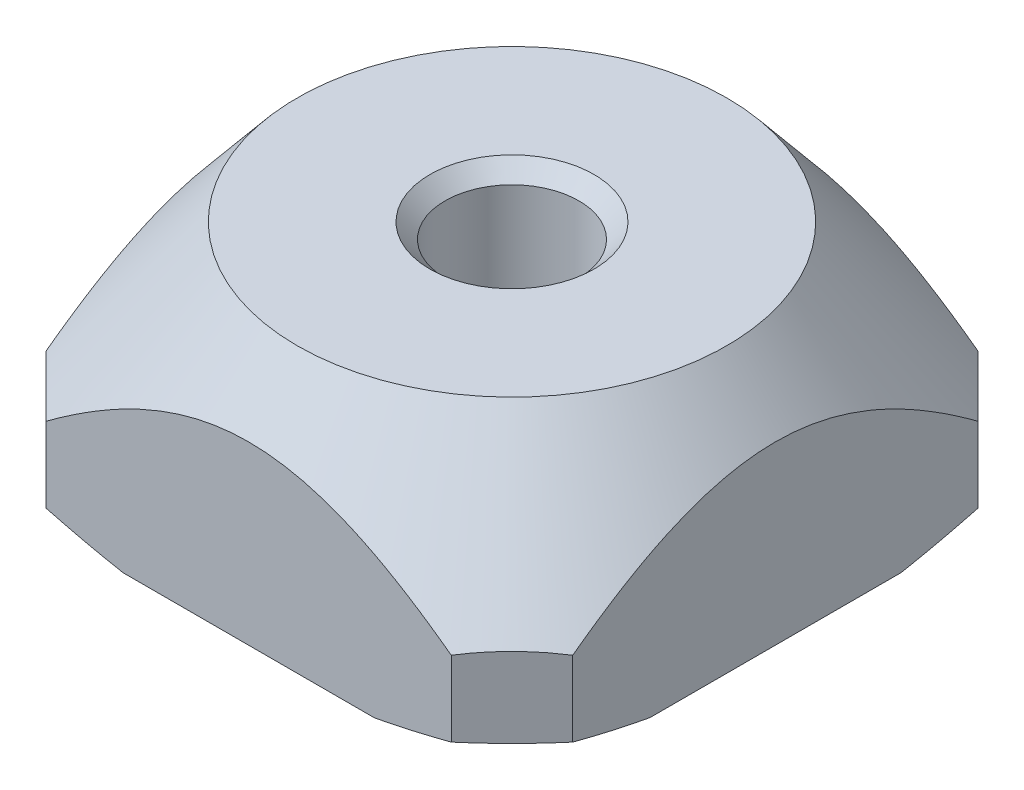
ISO-10303-21;
HEADER;
FILE_DESCRIPTION(('STEP AP214'),'2;1');
FILE_NAME('part.step','',(''),(''),'','','');
FILE_SCHEMA(('AUTOMOTIVE_DESIGN { 1 0 10303 214 1 1 1 1 }'));
ENDSEC;
DATA;
#1=APPLICATION_CONTEXT('core data for automotive mechanical design processes');
#2=APPLICATION_PROTOCOL_DEFINITION('international standard','automotive_design',2000,#1);
#3=PRODUCT_CONTEXT('',#1,'mechanical');
#4=PRODUCT('Part','Part','',(#3));
#5=PRODUCT_RELATED_PRODUCT_CATEGORY('part','',(#4));
#6=PRODUCT_DEFINITION_FORMATION('','',#4);
#7=PRODUCT_DEFINITION_CONTEXT('part definition',#1,'design');
#8=PRODUCT_DEFINITION('design','',#6,#7);
#9=PRODUCT_DEFINITION_SHAPE('','',#8);
#10=(LENGTH_UNIT() NAMED_UNIT(*) SI_UNIT(.MILLI.,.METRE.));
#11=(NAMED_UNIT(*) PLANE_ANGLE_UNIT() SI_UNIT($,.RADIAN.));
#12=(NAMED_UNIT(*) SI_UNIT($,.STERADIAN.) SOLID_ANGLE_UNIT());
#13=UNCERTAINTY_MEASURE_WITH_UNIT(LENGTH_MEASURE(1.E-05),#10,'distance_accuracy_value','');
#14=(GEOMETRIC_REPRESENTATION_CONTEXT(3) GLOBAL_UNCERTAINTY_ASSIGNED_CONTEXT((#13)) GLOBAL_UNIT_ASSIGNED_CONTEXT((#10,
#11,#12)) REPRESENTATION_CONTEXT('',''));
#15=CARTESIAN_POINT('',(0.,0.,0.));
#16=DIRECTION('',(0.,0.,1.));
#17=DIRECTION('',(1.,0.,0.));
#18=AXIS2_PLACEMENT_3D('',#15,#16,#17);
#19=CARTESIAN_POINT('',(0.,5.8,0.));
#20=DIRECTION('',(0.,-1.,0.));
#21=DIRECTION('',(0.,0.,-1.));
#22=AXIS2_PLACEMENT_3D('',#19,#20,#21);
#23=PLANE('',#22);
#24=CARTESIAN_POINT('',(0.,5.8,0.));
#25=DIRECTION('',(0.,-1.,0.));
#26=DIRECTION('',(0.,0.,-1.));
#27=AXIS2_PLACEMENT_3D('',#24,#25,#26);
#28=CIRCLE('',#27,5.3);
#29=CARTESIAN_POINT('',(0.,5.8,-5.3));
#30=VERTEX_POINT('',#29);
#31=EDGE_CURVE('E471',#30,#30,#28,.T.);
#32=ORIENTED_EDGE('',*,*,#31,.F.);
#33=EDGE_LOOP('',(#32));
#34=FACE_BOUND('',#33,.T.);
#35=CARTESIAN_POINT('',(0.,5.79999999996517,0.));
#36=DIRECTION('',(0.,1.,0.));
#37=DIRECTION('',(0.,0.,1.));
#38=AXIS2_PLACEMENT_3D('',#35,#36,#37);
#39=CIRCLE('',#38,2.02499999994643);
#40=CARTESIAN_POINT('',(0.,5.79999999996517,2.02499999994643));
#41=VERTEX_POINT('',#40);
#42=EDGE_CURVE('E19',#41,#41,#39,.F.);
#43=ORIENTED_EDGE('',*,*,#42,.T.);
#44=EDGE_LOOP('',(#43));
#45=FACE_BOUND('',#44,.T.);
#46=ADVANCED_FACE('F16',(#34,#45),#23,.F.);
#47=CARTESIAN_POINT('',(0.,5.79999999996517,0.));
#48=DIRECTION('',(0.,1.,0.));
#49=DIRECTION('',(0.,0.,1.));
#50=AXIS2_PLACEMENT_3D('',#47,#48,#49);
#51=CONICAL_SURFACE('',#50,2.02499999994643,0.785398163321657);
#52=ORIENTED_EDGE('',*,*,#42,.F.);
#53=EDGE_LOOP('',(#52));
#54=FACE_BOUND('',#53,.T.);
#55=CARTESIAN_POINT('',(0.,5.425,0.));
#56=DIRECTION('',(0.,1.,0.));
#57=DIRECTION('',(0.,0.,1.));
#58=AXIS2_PLACEMENT_3D('',#55,#56,#57);
#59=CIRCLE('',#58,1.65);
#60=CARTESIAN_POINT('',(0.,5.425,1.65));
#61=VERTEX_POINT('',#60);
#62=EDGE_CURVE('E150',#61,#61,#59,.F.);
#63=ORIENTED_EDGE('',*,*,#62,.T.);
#64=EDGE_LOOP('',(#63));
#65=FACE_BOUND('',#64,.T.);
#66=ADVANCED_FACE('F358',(#54,#65),#51,.F.);
#67=CARTESIAN_POINT('',(5.00093362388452,37.1474583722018,-6.5));
#68=DIRECTION('',(0.707106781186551,0.,-0.707106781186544));
#69=DIRECTION('',(-0.707106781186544,0.,-0.707106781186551));
#70=AXIS2_PLACEMENT_3D('',#67,#68,#69);
#71=PLANE('',#70);
#72=DIRECTION('',(0.,1.,0.));
#73=VECTOR('',#72,1.);
#74=CARTESIAN_POINT('',(5.00093362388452,5.8,-6.5));
#75=LINE('',#74,#73);
#76=CARTESIAN_POINT('',(5.00093356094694,0.429511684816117,-6.50000006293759));
#77=VERTEX_POINT('',#76);
#78=CARTESIAN_POINT('',(5.00093364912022,2.28669481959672,-6.49999997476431));
#79=VERTEX_POINT('',#78);
#80=EDGE_CURVE('E108',#77,#79,#75,.T.);
#81=ORIENTED_EDGE('',*,*,#80,.T.);
#82=CARTESIAN_POINT('',(6.50000003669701,2.28669480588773,-5.0009335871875));
#83=CARTESIAN_POINT('',(6.43784742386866,2.30045539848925,-5.06308620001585));
#84=CARTESIAN_POINT('',(6.37551621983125,2.31256643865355,-5.12541740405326));
#85=CARTESIAN_POINT('',(6.25056780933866,2.33340084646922,-5.25036581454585));
#86=CARTESIAN_POINT('',(6.18795058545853,2.34212400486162,-5.31298303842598));
#87=CARTESIAN_POINT('',(6.00058150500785,2.36298820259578,-5.50035211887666));
#88=CARTESIAN_POINT('',(5.87552418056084,2.36999999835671,-5.62540944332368));
#89=CARTESIAN_POINT('',(5.62540953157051,2.3700000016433,-5.87552409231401));
#90=CARTESIAN_POINT('',(5.5003522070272,2.36298820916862,-6.00058141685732));
#91=CARTESIAN_POINT('',(5.31298312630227,2.34212401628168,-6.18795049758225));
#92=CARTESIAN_POINT('',(5.25036590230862,2.33340085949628,-6.25056772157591));
#93=CARTESIAN_POINT('',(5.12541749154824,2.31256645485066,-6.37551613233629));
#94=CARTESIAN_POINT('',(5.06308628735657,2.30045541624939,-6.43784733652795));
#95=CARTESIAN_POINT('',(5.00093367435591,2.28669482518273,-6.49999994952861));
#96=B_SPLINE_CURVE_WITH_KNOTS('',3,(#82,#83,#84,#85,#86,#87,#88,#89,#90,#91,#92,#93,#94,#95),
.UNSPECIFIED.,.F.,.F.,(4,2,2,2,2,2,4),(0.,0.26687453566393,0.533765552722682,1.06417199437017,
1.59457843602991,1.86146945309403,2.12834398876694),.UNSPECIFIED.);
#97=CARTESIAN_POINT('',(6.5000000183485,2.28669481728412,-5.00093359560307));
#98=VERTEX_POINT('',#97);
#99=EDGE_CURVE('E101',#98,#79,#96,.T.);
#100=ORIENTED_EDGE('',*,*,#99,.F.);
#101=DIRECTION('',(0.,1.,0.));
#102=VECTOR('',#101,1.);
#103=CARTESIAN_POINT('',(6.5,5.8,-5.00093362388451));
#104=LINE('',#103,#102);
#105=CARTESIAN_POINT('',(6.50000003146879,0.429511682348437,-5.00093359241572));
#106=VERTEX_POINT('',#105);
#107=EDGE_CURVE('E106',#98,#106,#104,.F.);
#108=ORIENTED_EDGE('',*,*,#107,.T.);
#109=CARTESIAN_POINT('',(5.00093349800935,0.429511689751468,-6.50000012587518));
#110=CARTESIAN_POINT('',(5.12577543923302,0.419709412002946,-6.37515818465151));
#111=CARTESIAN_POINT('',(5.25071389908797,0.412329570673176,-6.25021972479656));
#112=CARTESIAN_POINT('',(5.50059054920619,0.402476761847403,-6.00034307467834));
#113=CARTESIAN_POINT('',(5.62552866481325,0.400000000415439,-5.87540495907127));
#114=CARTESIAN_POINT('',(5.8754048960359,0.399999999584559,-5.62552872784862));
#115=CARTESIAN_POINT('',(6.00034301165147,0.40247676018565,-5.50059061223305));
#116=CARTESIAN_POINT('',(6.25021966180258,0.412329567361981,-5.25071396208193));
#117=CARTESIAN_POINT('',(6.37515812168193,0.419709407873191,-5.12577550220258));
#118=CARTESIAN_POINT('',(6.50000006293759,0.429511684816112,-5.00093356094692));
#119=B_SPLINE_CURVE_WITH_KNOTS('',3,(#109,#110,#111,#112,#113,#114,#115,#116,#117,#118),
.UNSPECIFIED.,.F.,.F.,(4,2,2,2,4),(0.,0.530461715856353,1.06051280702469,1.59056389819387,
2.12102561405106),.UNSPECIFIED.);
#120=EDGE_CURVE('E141',#77,#106,#119,.T.);
#121=ORIENTED_EDGE('',*,*,#120,.F.);
#122=EDGE_LOOP('',(#81,#100,#108,#121));
#123=FACE_BOUND('',#122,.T.);
#124=ADVANCED_FACE('F103',(#123),#71,.T.);
#125=CARTESIAN_POINT('',(6.50000000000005,29.8974583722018,5.00093362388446));
#126=DIRECTION('',(0.707106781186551,0.,0.707106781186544));
#127=DIRECTION('',(0.707106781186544,0.,-0.707106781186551));
#128=AXIS2_PLACEMENT_3D('',#125,#126,#127);
#129=PLANE('',#128);
#130=DIRECTION('',(0.,1.,0.));
#131=VECTOR('',#130,1.);
#132=CARTESIAN_POINT('',(6.5,5.8,5.00093362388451));
#133=LINE('',#132,#131);
#134=CARTESIAN_POINT('',(6.50000006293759,0.429511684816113,5.00093356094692));
#135=VERTEX_POINT('',#134);
#136=CARTESIAN_POINT('',(6.5,2.28669481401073,5.00093362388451));
#137=VERTEX_POINT('',#136);
#138=EDGE_CURVE('E120',#135,#137,#133,.T.);
#139=ORIENTED_EDGE('',*,*,#138,.T.);
#140=CARTESIAN_POINT('',(6.5,2.28669481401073,5.00093362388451));
#141=CARTESIAN_POINT('',(6.43784738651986,2.30045540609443,5.06308623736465));
#142=CARTESIAN_POINT('',(6.37551618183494,2.31256644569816,5.12541744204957));
#143=CARTESIAN_POINT('',(6.25056777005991,2.33340085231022,5.25036585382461));
#144=CARTESIAN_POINT('',(6.18795054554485,2.34212401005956,5.31298307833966));
#145=CARTESIAN_POINT('',(6.00058146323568,2.36298820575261,5.50035216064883));
#146=CARTESIAN_POINT('',(5.87552413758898,2.37,5.62540948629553));
#147=CARTESIAN_POINT('',(5.62540948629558,2.37,5.87552413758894));
#148=CARTESIAN_POINT('',(5.50035216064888,2.36298820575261,6.00058146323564));
#149=CARTESIAN_POINT('',(5.31298307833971,2.34212401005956,6.18795054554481));
#150=CARTESIAN_POINT('',(5.25036585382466,2.33340085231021,6.25056777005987));
#151=CARTESIAN_POINT('',(5.12541744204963,2.31256644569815,6.3755161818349));
#152=CARTESIAN_POINT('',(5.0630862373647,2.30045540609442,6.43784738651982));
#153=CARTESIAN_POINT('',(5.00093362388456,2.28669481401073,6.49999999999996));
#154=B_SPLINE_CURVE_WITH_KNOTS('',3,(#140,#141,#142,#143,#144,#145,#146,#147,#148,#149,#150,
#151,#152,#153),.UNSPECIFIED.,.F.,.F.,(4,2,2,2,2,2,4),(0.,0.266874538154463,0.533765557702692,
1.06417200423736,1.59457845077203,1.86146947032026,2.12834400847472),.UNSPECIFIED.);
#155=CARTESIAN_POINT('',(5.00093362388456,2.28669481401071,6.49999999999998));
#156=VERTEX_POINT('',#155);
#157=EDGE_CURVE('E111',#137,#156,#154,.T.);
#158=ORIENTED_EDGE('',*,*,#157,.T.);
#159=DIRECTION('',(0.,1.,0.));
#160=VECTOR('',#159,1.);
#161=CARTESIAN_POINT('',(5.00093362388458,5.8,6.5));
#162=LINE('',#161,#160);
#163=CARTESIAN_POINT('',(5.00093359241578,0.429511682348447,6.50000003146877));
#164=VERTEX_POINT('',#163);
#165=EDGE_CURVE('E260',#156,#164,#162,.F.);
#166=ORIENTED_EDGE('',*,*,#165,.T.);
#167=CARTESIAN_POINT('',(6.50000012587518,0.429511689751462,5.00093349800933));
#168=CARTESIAN_POINT('',(6.37515818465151,0.419709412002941,5.125775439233));
#169=CARTESIAN_POINT('',(6.25021972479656,0.412329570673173,5.25071389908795));
#170=CARTESIAN_POINT('',(6.00034307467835,0.402476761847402,5.50059054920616));
#171=CARTESIAN_POINT('',(5.87540495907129,0.400000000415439,5.62552866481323));
#172=CARTESIAN_POINT('',(5.62552872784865,0.39999999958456,5.87540489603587));
#173=CARTESIAN_POINT('',(5.50059061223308,0.402476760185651,6.00034301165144));
#174=CARTESIAN_POINT('',(5.25071396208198,0.412329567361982,6.25021966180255));
#175=CARTESIAN_POINT('',(5.12577550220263,0.419709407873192,6.3751581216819));
#176=CARTESIAN_POINT('',(5.00093356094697,0.429511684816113,6.50000006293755));
#177=B_SPLINE_CURVE_WITH_KNOTS('',3,(#167,#168,#169,#170,#171,#172,#173,#174,#175,#176),
.UNSPECIFIED.,.F.,.F.,(4,2,2,2,4),(0.,0.530461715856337,1.06051280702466,1.59056389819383,
2.121025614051),.UNSPECIFIED.);
#178=EDGE_CURVE('E275',#135,#164,#177,.T.);
#179=ORIENTED_EDGE('',*,*,#178,.F.);
#180=EDGE_LOOP('',(#139,#158,#166,#179));
#181=FACE_BOUND('',#180,.T.);
#182=ADVANCED_FACE('F330',(#181),#129,.T.);
#183=CARTESIAN_POINT('',(0.,2.26561498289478,0.));
#184=DIRECTION('',(0.,-1.,0.));
#185=DIRECTION('',(0.,0.,-1.));
#186=AXIS2_PLACEMENT_3D('',#183,#184,#185);
#187=CONICAL_SURFACE('',#186,8.218586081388,0.690257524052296);
#188=ORIENTED_EDGE('',*,*,#31,.T.);
#189=EDGE_LOOP('',(#188));
#190=FACE_BOUND('',#189,.T.);
#191=CARTESIAN_POINT('',(-5.00093362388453,2.28669481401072,6.5));
#192=CARTESIAN_POINT('',(-5.06308623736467,2.30045540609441,6.43784738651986));
#193=CARTESIAN_POINT('',(-5.12541744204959,2.31256644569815,6.37551618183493));
#194=CARTESIAN_POINT('',(-5.25036585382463,2.33340085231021,6.2505677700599));
#195=CARTESIAN_POINT('',(-5.31298307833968,2.34212401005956,6.18795054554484));
#196=CARTESIAN_POINT('',(-5.50035216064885,2.3629882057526,6.00058146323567));
#197=CARTESIAN_POINT('',(-5.62540948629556,2.37,5.87552413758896));
#198=CARTESIAN_POINT('',(-5.87552413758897,2.37000000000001,5.62540948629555));
#199=CARTESIAN_POINT('',(-6.00058146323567,2.36298820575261,5.50035216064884));
#200=CARTESIAN_POINT('',(-6.18795054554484,2.34212401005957,5.31298307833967));
#201=CARTESIAN_POINT('',(-6.2505677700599,2.33340085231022,5.25036585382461));
#202=CARTESIAN_POINT('',(-6.37551618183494,2.31256644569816,5.12541744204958));
#203=CARTESIAN_POINT('',(-6.43784738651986,2.30045540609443,5.06308623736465));
#204=CARTESIAN_POINT('',(-6.5,2.28669481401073,5.00093362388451));
#205=B_SPLINE_CURVE_WITH_KNOTS('',3,(#191,#192,#193,#194,#195,#196,#197,#198,#199,#200,#201,
#202,#203,#204),.UNSPECIFIED.,.F.,.F.,(4,2,2,2,2,2,4),(0.,0.26687453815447,0.533765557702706,
1.06417200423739,1.59457845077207,1.8614694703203,2.12834400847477),.UNSPECIFIED.);
#206=CARTESIAN_POINT('',(-5.00093362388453,2.28669481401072,6.5));
#207=VERTEX_POINT('',#206);
#208=CARTESIAN_POINT('',(-6.5,2.28669481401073,5.00093362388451));
#209=VERTEX_POINT('',#208);
#210=EDGE_CURVE('E336',#207,#209,#205,.T.);
#211=ORIENTED_EDGE('',*,*,#210,.F.);
#212=CARTESIAN_POINT('',(-5.00093362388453,2.28669481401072,6.5));
#213=CARTESIAN_POINT('',(-4.89461882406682,2.36519488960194,6.5));
#214=CARTESIAN_POINT('',(-4.78756060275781,2.44268666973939,6.5));
#215=CARTESIAN_POINT('',(-4.57178170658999,2.59536506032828,6.5));
#216=CARTESIAN_POINT('',(-4.46306069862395,2.67055119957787,6.5));
#217=CARTESIAN_POINT('',(-4.13342181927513,2.89269870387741,6.5));
#218=CARTESIAN_POINT('',(-3.90978571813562,3.03568366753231,6.5));
#219=CARTESIAN_POINT('',(-3.4465789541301,3.31215846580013,6.5));
#220=CARTESIAN_POINT('',(-3.20672602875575,3.44517986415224,6.5));
#221=CARTESIAN_POINT('',(-2.7170779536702,3.69103259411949,6.5));
#222=CARTESIAN_POINT('',(-2.46729714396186,3.80389183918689,6.5));
#223=CARTESIAN_POINT('',(-2.03482702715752,3.97262521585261,6.5));
#224=CARTESIAN_POINT('',(-1.85483896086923,4.03539099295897,6.5));
#225=CARTESIAN_POINT('',(-1.49011877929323,4.14544511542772,6.5));
#226=CARTESIAN_POINT('',(-1.30538676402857,4.19273378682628,6.5));
#227=CARTESIAN_POINT('',(-0.934834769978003,4.26884620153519,6.5));
#228=CARTESIAN_POINT('',(-0.749067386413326,4.29792233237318,6.5));
#229=CARTESIAN_POINT('',(-0.375528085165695,4.33690000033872,6.5));
#230=CARTESIAN_POINT('',(-0.187756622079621,4.34680579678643,6.5));
#231=CARTESIAN_POINT('',(0.16789069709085,4.34681251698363,6.5));
#232=CARTESIAN_POINT('',(0.335769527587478,4.33889803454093,6.5));
#233=CARTESIAN_POINT('',(0.670076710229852,4.30766815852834,6.5));
#234=CARTESIAN_POINT('',(0.836505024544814,4.28435236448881,6.5));
#235=CARTESIAN_POINT('',(1.16887468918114,4.22305769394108,6.5));
#236=CARTESIAN_POINT('',(1.3347807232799,4.18488964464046,6.5));
#237=CARTESIAN_POINT('',(1.66300269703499,4.09557989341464,6.5));
#238=CARTESIAN_POINT('',(1.82531875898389,4.04443863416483,6.5));
#239=CARTESIAN_POINT('',(2.26283278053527,3.88965064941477,6.5));
#240=CARTESIAN_POINT('',(2.53410341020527,3.77489830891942,6.5));
#241=CARTESIAN_POINT('',(3.06513239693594,3.5205626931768,6.5));
#242=CARTESIAN_POINT('',(3.32486424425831,3.38092559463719,6.5));
#243=CARTESIAN_POINT('',(3.702501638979,3.16031756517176,6.5));
#244=CARTESIAN_POINT('',(3.82449988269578,3.08620976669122,6.5));
#245=CARTESIAN_POINT('',(4.06621203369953,2.93433161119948,6.5));
#246=CARTESIAN_POINT('',(4.18592578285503,2.85656100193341,6.5));
#247=CARTESIAN_POINT('',(4.422624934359,2.69829475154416,6.5));
#248=CARTESIAN_POINT('',(4.53962131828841,2.6178154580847,6.5));
#249=CARTESIAN_POINT('',(4.77167680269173,2.45417264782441,6.5));
#250=CARTESIAN_POINT('',(4.88673641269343,2.37100985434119,6.5));
#251=CARTESIAN_POINT('',(5.00093362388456,2.2866948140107,6.5));
#252=B_SPLINE_CURVE_WITH_KNOTS('',3,(#212,#213,#214,#215,#216,#217,#218,#219,#220,#221,#222,
#223,#224,#225,#226,#227,#228,#229,#230,#231,#232,#233,#234,#235,#236,#237,#238,#239,#240,#241,
#242,#243,#244,#245,#246,#247,#248,#249,#250,#251),.UNSPECIFIED.,.F.,.F.,(4,2,2,2,2,2,2,2,2,2,2,
2,2,2,2,2,2,2,2,4),(0.,0.396455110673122,0.792990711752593,1.58889552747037,2.41103939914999,
3.23203608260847,3.80332089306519,4.37459366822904,4.93776368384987,5.50080855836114,
6.00427946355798,6.50776346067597,7.01788207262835,7.52798328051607,8.40977024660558,
9.29348810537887,9.72166656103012,10.1498745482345,10.5758468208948,11.0017052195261),.UNSPECIFIED.);
#253=EDGE_CURVE('E261',#207,#156,#252,.T.);
#254=ORIENTED_EDGE('',*,*,#253,.T.);
#255=ORIENTED_EDGE('',*,*,#157,.F.);
#256=CARTESIAN_POINT('',(6.5,2.28669481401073,5.00093362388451));
#257=CARTESIAN_POINT('',(6.5,2.36546542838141,4.89425230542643));
#258=CARTESIAN_POINT('',(6.5,2.44322075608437,4.78682264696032));
#259=CARTESIAN_POINT('',(6.5,2.59640967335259,4.57028828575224));
#260=CARTESIAN_POINT('',(6.5,2.67184277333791,4.46118323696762));
#261=CARTESIAN_POINT('',(6.5,2.89472597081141,4.13033374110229));
#262=CARTESIAN_POINT('',(6.5,3.03816727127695,3.90584895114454));
#263=CARTESIAN_POINT('',(6.5,3.31446263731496,3.44248350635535));
#264=CARTESIAN_POINT('',(6.5,3.44694761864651,3.20338079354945));
#265=CARTESIAN_POINT('',(6.5,3.69182258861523,2.71532773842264));
#266=CARTESIAN_POINT('',(6.5,3.80424366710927,2.46639337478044));
#267=CARTESIAN_POINT('',(6.5,3.96403148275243,2.05685433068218));
#268=CARTESIAN_POINT('',(6.5,4.01970687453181,1.89949160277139));
#269=CARTESIAN_POINT('',(6.5,4.11943260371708,1.58107070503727));
#270=CARTESIAN_POINT('',(6.5,4.16348252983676,1.42001240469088));
#271=CARTESIAN_POINT('',(6.5,4.23795252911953,1.09621460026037));
#272=CARTESIAN_POINT('',(6.5,4.26848771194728,0.93350186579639));
#273=CARTESIAN_POINT('',(6.5,4.31512465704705,0.606006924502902));
#274=CARTESIAN_POINT('',(6.5,4.33122767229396,0.441224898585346));
#275=CARTESIAN_POINT('',(6.5,4.34827314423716,0.109455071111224));
#276=CARTESIAN_POINT('',(6.5,4.34908501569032,-0.0575395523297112));
#277=CARTESIAN_POINT('',(6.5,4.33517110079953,-0.390873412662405));
#278=CARTESIAN_POINT('',(6.5,4.32044494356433,-0.557212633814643));
#279=CARTESIAN_POINT('',(6.5,4.2761251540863,-0.88848991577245));
#280=CARTESIAN_POINT('',(6.5,4.24647760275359,-1.05342067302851));
#281=CARTESIAN_POINT('',(6.5,4.17365597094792,-1.3802445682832));
#282=CARTESIAN_POINT('',(6.5,4.13047995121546,-1.54213726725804));
#283=CARTESIAN_POINT('',(6.5,4.00941900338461,-1.93674499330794));
#284=CARTESIAN_POINT('',(6.5,3.92473121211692,-2.16737187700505));
#285=CARTESIAN_POINT('',(6.5,3.73524387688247,-2.62020320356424));
#286=CARTESIAN_POINT('',(6.5,3.6304297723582,-2.84240140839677));
#287=CARTESIAN_POINT('',(6.5,3.40508735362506,-3.27921361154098));
#288=CARTESIAN_POINT('',(6.5,3.2845244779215,-3.49380956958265));
#289=CARTESIAN_POINT('',(6.5,3.03152298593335,-3.91571764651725));
#290=CARTESIAN_POINT('',(6.5,2.89908838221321,-4.12303219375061));
#291=CARTESIAN_POINT('',(6.5,2.68529870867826,-4.44159950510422));
#292=CARTESIAN_POINT('',(6.5,2.60709917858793,-4.55499497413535));
#293=CARTESIAN_POINT('',(6.5,2.44851798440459,-4.77950010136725));
#294=CARTESIAN_POINT('',(6.5,2.36814750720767,-4.89061765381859));
#295=CARTESIAN_POINT('',(6.5,2.28669482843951,-5.00093360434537));
#296=B_SPLINE_CURVE_WITH_KNOTS('',3,(#256,#257,#258,#259,#260,#261,#262,#263,#264,#265,#266,
#267,#268,#269,#270,#271,#272,#273,#274,#275,#276,#277,#278,#279,#280,#281,#282,#283,#284,#285,
#286,#287,#288,#289,#290,#291,#292,#293,#294,#295),.UNSPECIFIED.,.F.,.F.,(4,2,2,2,2,2,2,2,2,2,2,
2,2,2,2,2,2,2,2,4),(0.,0.39782125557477,0.795725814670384,1.59450470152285,2.41391220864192,
3.23203877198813,3.7324336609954,4.23284625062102,4.72891053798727,5.22493175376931,
5.72518705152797,6.22545429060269,6.727542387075,7.2297024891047,7.96546321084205,
8.70175824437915,9.43969714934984,10.1773875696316,10.590593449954,11.0019709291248),.UNSPECIFIED.);
#297=EDGE_CURVE('E113',#137,#98,#296,.T.);
#298=ORIENTED_EDGE('',*,*,#297,.T.);
#299=ORIENTED_EDGE('',*,*,#99,.T.);
#300=CARTESIAN_POINT('',(5.00093365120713,2.28669479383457,-6.5));
#301=CARTESIAN_POINT('',(4.89461885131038,2.36519486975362,-6.5));
#302=CARTESIAN_POINT('',(4.78756062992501,2.442686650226,-6.5));
#303=CARTESIAN_POINT('',(4.57178173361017,2.59536504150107,-6.5));
#304=CARTESIAN_POINT('',(4.46306072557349,2.67055118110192,-6.5));
#305=CARTESIAN_POINT('',(4.13342184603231,2.89269868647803,-6.5));
#306=CARTESIAN_POINT('',(3.90978574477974,3.03568365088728,-6.5));
#307=CARTESIAN_POINT('',(3.44657898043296,3.31215845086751,-6.5));
#308=CARTESIAN_POINT('',(3.20672605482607,3.44517985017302,-6.5));
#309=CARTESIAN_POINT('',(2.71707797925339,3.69103258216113,-6.5));
#310=CARTESIAN_POINT('',(2.46729716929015,3.80389182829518,-6.5));
#311=CARTESIAN_POINT('',(2.03482705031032,3.97262520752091,-6.5));
#312=CARTESIAN_POINT('',(1.85483898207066,4.0353909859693,-6.5));
#313=CARTESIAN_POINT('',(1.49011879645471,4.1454451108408,-6.5));
#314=CARTESIAN_POINT('',(1.30538677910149,4.19273378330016,-6.5));
#315=CARTESIAN_POINT('',(0.934834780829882,4.26884619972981,-6.5));
#316=CARTESIAN_POINT('',(0.749067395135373,4.29792233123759,-6.5));
#317=CARTESIAN_POINT('',(0.37552808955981,4.33690000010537,-6.5));
#318=CARTESIAN_POINT('',(0.18775662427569,4.34680579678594,-6.5));
#319=CARTESIAN_POINT('',(-0.167890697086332,4.34681251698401,-6.5));
#320=CARTESIAN_POINT('',(-0.335769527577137,4.33889803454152,-6.5));
#321=CARTESIAN_POINT('',(-0.67007671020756,4.30766815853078,-6.5));
#322=CARTESIAN_POINT('',(-0.836505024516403,4.28435236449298,-6.5));
#323=CARTESIAN_POINT('',(-1.16887468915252,4.22305769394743,-6.5));
#324=CARTESIAN_POINT('',(-1.33478072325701,4.1848896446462,-6.5));
#325=CARTESIAN_POINT('',(-1.66300269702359,4.09557989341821,-6.5));
#326=CARTESIAN_POINT('',(-1.82531875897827,4.04443863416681,-6.5));
#327=CARTESIAN_POINT('',(-2.26283278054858,3.88965064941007,-6.5));
#328=CARTESIAN_POINT('',(-2.53410341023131,3.77489830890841,-6.5));
#329=CARTESIAN_POINT('',(-3.06513239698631,3.52056269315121,-6.5));
#330=CARTESIAN_POINT('',(-3.32486424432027,3.38092559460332,-6.5));
#331=CARTESIAN_POINT('',(-3.7025016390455,3.16031756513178,-6.5));
#332=CARTESIAN_POINT('',(-3.82449988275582,3.08620976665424,-6.5));
#333=CARTESIAN_POINT('',(-4.0662120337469,2.93433161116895,-6.5));
#334=CARTESIAN_POINT('',(-4.18592578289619,2.85656100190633,-6.5));
#335=CARTESIAN_POINT('',(-4.422624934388,2.69829475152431,-6.5));
#336=CARTESIAN_POINT('',(-4.53962131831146,2.61781545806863,-6.5));
#337=CARTESIAN_POINT('',(-4.77167680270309,2.45417264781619,-6.5));
#338=CARTESIAN_POINT('',(-4.88673641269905,2.37100985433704,-6.5));
#339=CARTESIAN_POINT('',(-5.00093362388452,2.28669481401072,-6.5));
#340=B_SPLINE_CURVE_WITH_KNOTS('',3,(#300,#301,#302,#303,#304,#305,#306,#307,#308,#309,#310,
#311,#312,#313,#314,#315,#316,#317,#318,#319,#320,#321,#322,#323,#324,#325,#326,#327,#328,#329,
#330,#331,#332,#333,#334,#335,#336,#337,#338,#339),.UNSPECIFIED.,.F.,.F.,(4,2,2,2,2,2,2,2,2,2,2,
2,2,2,2,2,2,2,2,4),(0.,0.396455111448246,0.792990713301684,1.5888955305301,2.41103940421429,
3.23203608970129,3.80332090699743,4.37459368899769,4.93776371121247,5.50080859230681,
6.00427949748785,6.50776349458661,7.01788210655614,7.52798331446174,8.40977028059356,
9.29348813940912,9.72166659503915,10.1498745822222,10.5758468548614,11.0017052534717),.UNSPECIFIED.);
#341=CARTESIAN_POINT('',(-5.00093362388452,2.28669481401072,-6.5));
#342=VERTEX_POINT('',#341);
#343=EDGE_CURVE('E147',#79,#342,#340,.T.);
#344=ORIENTED_EDGE('',*,*,#343,.T.);
#345=CARTESIAN_POINT('',(-6.5,2.28669481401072,-5.00093362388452));
#346=CARTESIAN_POINT('',(-6.43784738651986,2.30045540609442,-5.06308623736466));
#347=CARTESIAN_POINT('',(-6.37551618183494,2.31256644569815,-5.12541744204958));
#348=CARTESIAN_POINT('',(-6.2505677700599,2.33340085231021,-5.25036585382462));
#349=CARTESIAN_POINT('',(-6.18795054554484,2.34212401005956,-5.31298307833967));
#350=CARTESIAN_POINT('',(-6.00058146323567,2.36298820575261,-5.50035216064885));
#351=CARTESIAN_POINT('',(-5.87552413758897,2.37,-5.62540948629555));
#352=CARTESIAN_POINT('',(-5.62540948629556,2.37000000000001,-5.87552413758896));
#353=CARTESIAN_POINT('',(-5.50035216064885,2.36298820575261,-6.00058146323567));
#354=CARTESIAN_POINT('',(-5.31298307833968,2.34212401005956,-6.18795054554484));
#355=CARTESIAN_POINT('',(-5.25036585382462,2.33340085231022,-6.2505677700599));
#356=CARTESIAN_POINT('',(-5.12541744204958,2.31256644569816,-6.37551618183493));
#357=CARTESIAN_POINT('',(-5.06308623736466,2.30045540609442,-6.43784738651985));
#358=CARTESIAN_POINT('',(-5.00093362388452,2.28669481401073,-6.5));
#359=B_SPLINE_CURVE_WITH_KNOTS('',3,(#345,#346,#347,#348,#349,#350,#351,#352,#353,#354,#355,
#356,#357,#358),.UNSPECIFIED.,.F.,.F.,(4,2,2,2,2,2,4),(0.,0.26687453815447,0.533765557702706,
1.06417200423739,1.59457845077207,1.8614694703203,2.12834400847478),.UNSPECIFIED.);
#360=CARTESIAN_POINT('',(-6.5,2.28669481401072,-5.00093362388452));
#361=VERTEX_POINT('',#360);
#362=EDGE_CURVE('E153',#361,#342,#359,.T.);
#363=ORIENTED_EDGE('',*,*,#362,.F.);
#364=CARTESIAN_POINT('',(-6.5,2.28669481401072,-5.00093362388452));
#365=CARTESIAN_POINT('',(-6.5,2.36546542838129,-4.89425230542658));
#366=CARTESIAN_POINT('',(-6.5,2.44322075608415,-4.78682264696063));
#367=CARTESIAN_POINT('',(-6.5,2.59640967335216,-4.57028828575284));
#368=CARTESIAN_POINT('',(-6.5,2.67184277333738,-4.46118323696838));
#369=CARTESIAN_POINT('',(-6.5,2.89472597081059,-4.13033374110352));
#370=CARTESIAN_POINT('',(-6.5,3.03816727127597,-3.90584895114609));
#371=CARTESIAN_POINT('',(-6.5,3.31446263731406,-3.44248350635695));
#372=CARTESIAN_POINT('',(-6.5,3.44694761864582,-3.20338079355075));
#373=CARTESIAN_POINT('',(-6.5,3.69182258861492,-2.71532773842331));
#374=CARTESIAN_POINT('',(-6.5,3.80424366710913,-2.46639337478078));
#375=CARTESIAN_POINT('',(-6.5,3.96403148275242,-2.05685433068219));
#376=CARTESIAN_POINT('',(-6.5,4.0197068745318,-1.89949160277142));
#377=CARTESIAN_POINT('',(-6.5,4.11943260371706,-1.58107070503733));
#378=CARTESIAN_POINT('',(-6.5,4.16348252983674,-1.42001240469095));
#379=CARTESIAN_POINT('',(-6.5,4.23795252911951,-1.09621460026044));
#380=CARTESIAN_POINT('',(-6.5,4.26848771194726,-0.933501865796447));
#381=CARTESIAN_POINT('',(-6.5,4.31512465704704,-0.606006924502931));
#382=CARTESIAN_POINT('',(-6.5,4.33122767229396,-0.441224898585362));
#383=CARTESIAN_POINT('',(-6.5,4.34827314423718,-0.109455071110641));
#384=CARTESIAN_POINT('',(-6.5,4.34908501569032,0.0575395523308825));
#385=CARTESIAN_POINT('',(-6.5,4.33517110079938,0.390873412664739));
#386=CARTESIAN_POINT('',(-6.5,4.32044494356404,0.557212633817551));
#387=CARTESIAN_POINT('',(-6.5,4.2761251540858,0.888489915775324));
#388=CARTESIAN_POINT('',(-6.5,4.24647760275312,1.05342067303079));
#389=CARTESIAN_POINT('',(-6.5,4.17365597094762,1.38024456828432));
#390=CARTESIAN_POINT('',(-6.5,4.13047995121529,1.5421372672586));
#391=CARTESIAN_POINT('',(-6.5,4.00941900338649,1.93674499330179));
#392=CARTESIAN_POINT('',(-6.5,3.92473121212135,2.16737187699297));
#393=CARTESIAN_POINT('',(-6.5,3.73524387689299,2.62020320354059));
#394=CARTESIAN_POINT('',(-6.5,3.63042977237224,2.8424014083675));
#395=CARTESIAN_POINT('',(-6.5,3.40508735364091,3.2792136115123));
#396=CARTESIAN_POINT('',(-6.5,3.2845244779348,3.49380956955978));
#397=CARTESIAN_POINT('',(-6.5,3.03152298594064,3.91571764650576));
#398=CARTESIAN_POINT('',(-6.5,2.89908838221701,4.1230321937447));
#399=CARTESIAN_POINT('',(-6.5,2.68529870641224,4.44159950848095));
#400=CARTESIAN_POINT('',(-6.5,2.6070991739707,4.55499498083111));
#401=CARTESIAN_POINT('',(-6.5,2.44851797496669,4.77950011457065));
#402=CARTESIAN_POINT('',(-6.5,2.36814749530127,4.89061767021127));
#403=CARTESIAN_POINT('',(-6.5,2.28669481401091,5.00093362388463));
#404=B_SPLINE_CURVE_WITH_KNOTS('',3,(#364,#365,#366,#367,#368,#369,#370,#371,#372,#373,#374,
#375,#376,#377,#378,#379,#380,#381,#382,#383,#384,#385,#386,#387,#388,#389,#390,#391,#392,#393,
#394,#395,#396,#397,#398,#399,#400,#401,#402,#403),.UNSPECIFIED.,.F.,.F.,(4,2,2,2,2,2,2,2,2,2,2,
2,2,2,2,2,2,2,2,4),(0.,0.397821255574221,0.795725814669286,1.59450470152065,2.41391220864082,
3.23203877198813,3.73243366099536,4.23284625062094,4.72891053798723,5.22493175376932,
5.72518705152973,6.2254542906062,6.72754238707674,7.22970248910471,7.96546321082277,
8.70175824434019,9.43969714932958,10.1773875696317,10.5905934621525,11.0019709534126),.UNSPECIFIED.);
#405=EDGE_CURVE('E221',#361,#209,#404,.T.);
#406=ORIENTED_EDGE('',*,*,#405,.T.);
#407=EDGE_LOOP('',(#211,#254,#255,#298,#299,#344,#363,#406));
#408=FACE_BOUND('',#407,.T.);
#409=ADVANCED_FACE('F115',(#190,#408),#187,.T.);
#410=CARTESIAN_POINT('',(-5.00093362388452,29.8974583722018,6.5));
#411=DIRECTION('',(-0.707106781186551,0.,0.707106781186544));
#412=DIRECTION('',(0.707106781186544,0.,0.707106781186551));
#413=AXIS2_PLACEMENT_3D('',#410,#411,#412);
#414=PLANE('',#413);
#415=DIRECTION('',(0.,1.,0.));
#416=VECTOR('',#415,1.);
#417=CARTESIAN_POINT('',(-5.00093362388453,5.8,6.5));
#418=LINE('',#417,#416);
#419=CARTESIAN_POINT('',(-5.00093356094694,0.429511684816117,6.50000006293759));
#420=VERTEX_POINT('',#419);
#421=EDGE_CURVE('E137',#420,#207,#418,.T.);
#422=ORIENTED_EDGE('',*,*,#421,.T.);
#423=ORIENTED_EDGE('',*,*,#210,.T.);
#424=DIRECTION('',(0.,1.,0.));
#425=VECTOR('',#424,1.);
#426=CARTESIAN_POINT('',(-6.5,5.8,5.00093362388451));
#427=LINE('',#426,#425);
#428=CARTESIAN_POINT('',(-6.49999996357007,0.429511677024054,5.00093366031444));
#429=VERTEX_POINT('',#428);
#430=EDGE_CURVE('E220',#209,#429,#427,.F.);
#431=ORIENTED_EDGE('',*,*,#430,.T.);
#432=CARTESIAN_POINT('',(-5.00093349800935,0.429511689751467,6.50000012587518));
#433=CARTESIAN_POINT('',(-5.12577542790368,0.419709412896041,6.37515819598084));
#434=CARTESIAN_POINT('',(-5.25071387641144,0.412329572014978,6.25021974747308));
#435=CARTESIAN_POINT('',(-5.50059050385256,0.402476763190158,6.00034312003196));
#436=CARTESIAN_POINT('',(-5.62552860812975,0.400000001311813,5.87540501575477));
#437=CARTESIAN_POINT('',(-5.87540481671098,0.399999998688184,5.62552880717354));
#438=CARTESIAN_POINT('',(-6.00034292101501,0.402476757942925,5.5005907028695));
#439=CARTESIAN_POINT('',(-6.25021954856,0.412329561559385,5.25071407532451));
#440=CARTESIAN_POINT('',(-6.37515799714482,0.419709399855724,5.12577562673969));
#441=CARTESIAN_POINT('',(-6.49999992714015,0.429511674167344,5.00093369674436));
#442=B_SPLINE_CURVE_WITH_KNOTS('',3,(#432,#433,#434,#435,#436,#437,#438,#439,#440,#441),
.UNSPECIFIED.,.F.,.F.,(4,2,2,2,4),(0.,0.530461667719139,1.0605127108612,1.5905637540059,
2.12102542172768),.UNSPECIFIED.);
#443=EDGE_CURVE('E238',#420,#429,#442,.T.);
#444=ORIENTED_EDGE('',*,*,#443,.F.);
#445=EDGE_LOOP('',(#422,#423,#431,#444));
#446=FACE_BOUND('',#445,.T.);
#447=ADVANCED_FACE('F329',(#446),#414,.T.);
#448=CARTESIAN_POINT('',(-6.50000000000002,29.8974583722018,-5.0009336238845));
#449=DIRECTION('',(-0.707106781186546,0.,-0.707106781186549));
#450=DIRECTION('',(-0.707106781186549,0.,0.707106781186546));
#451=AXIS2_PLACEMENT_3D('',#448,#449,#450);
#452=PLANE('',#451);
#453=DIRECTION('',(0.,1.,0.));
#454=VECTOR('',#453,1.);
#455=CARTESIAN_POINT('',(-6.5,5.8,-5.00093362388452));
#456=LINE('',#455,#454);
#457=CARTESIAN_POINT('',(-6.50000006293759,0.429511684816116,-5.00093356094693));
#458=VERTEX_POINT('',#457);
#459=EDGE_CURVE('E395',#458,#361,#456,.T.);
#460=ORIENTED_EDGE('',*,*,#459,.T.);
#461=ORIENTED_EDGE('',*,*,#362,.T.);
#462=DIRECTION('',(0.,1.,0.));
#463=VECTOR('',#462,1.);
#464=CARTESIAN_POINT('',(-5.00093362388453,5.8,-6.5));
#465=LINE('',#464,#463);
#466=CARTESIAN_POINT('',(-5.00093369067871,0.42951169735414,-6.5));
#467=VERTEX_POINT('',#466);
#468=EDGE_CURVE('E142',#342,#467,#465,.F.);
#469=ORIENTED_EDGE('',*,*,#468,.T.);
#470=CARTESIAN_POINT('',(-6.50000012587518,0.429511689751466,-5.00093349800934));
#471=CARTESIAN_POINT('',(-6.37515819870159,0.419709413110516,-5.12577542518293));
#472=CARTESIAN_POINT('',(-6.25021975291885,0.41232957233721,-5.25071387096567));
#473=CARTESIAN_POINT('',(-6.00034313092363,0.40247676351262,-5.50059049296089));
#474=CARTESIAN_POINT('',(-5.87540502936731,0.400000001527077,-5.62552859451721));
#475=CARTESIAN_POINT('',(-5.62552882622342,0.399999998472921,-5.8754047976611));
#476=CARTESIAN_POINT('',(-5.50059072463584,0.402476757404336,-6.00034289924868));
#477=CARTESIAN_POINT('',(-5.2507141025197,0.412329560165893,-6.25021952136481));
#478=CARTESIAN_POINT('',(-5.12577565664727,0.41970939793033,-6.37515796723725));
#479=CARTESIAN_POINT('',(-5.00093372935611,0.429511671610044,-6.49999989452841));
#480=B_SPLINE_CURVE_WITH_KNOTS('',3,(#470,#471,#472,#473,#474,#475,#476,#477,#478,#479),
.UNSPECIFIED.,.F.,.F.,(4,2,2,2,4),(0.,0.530461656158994,1.06051268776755,1.59056371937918,
2.12102537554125),.UNSPECIFIED.);
#481=EDGE_CURVE('E184',#458,#467,#480,.T.);
#482=ORIENTED_EDGE('',*,*,#481,.F.);
#483=EDGE_LOOP('',(#460,#461,#469,#482));
#484=FACE_BOUND('',#483,.T.);
#485=ADVANCED_FACE('F377',(#484),#452,.T.);
#486=CARTESIAN_POINT('',(0.,5.8,0.));
#487=DIRECTION('',(0.,1.,0.));
#488=DIRECTION('',(0.,0.,1.));
#489=AXIS2_PLACEMENT_3D('',#486,#487,#488);
#490=CYLINDRICAL_SURFACE('',#489,1.65);
#491=ORIENTED_EDGE('',*,*,#62,.F.);
#492=EDGE_LOOP('',(#491));
#493=FACE_BOUND('',#492,.T.);
#494=CARTESIAN_POINT('',(0.,0.,0.));
#495=DIRECTION('',(0.,1.,0.));
#496=DIRECTION('',(0.,0.,1.));
#497=AXIS2_PLACEMENT_3D('',#494,#495,#496);
#498=CIRCLE('',#497,1.65);
#499=CARTESIAN_POINT('',(0.,0.,1.65));
#500=VERTEX_POINT('',#499);
#501=EDGE_CURVE('E170',#500,#500,#498,.T.);
#502=ORIENTED_EDGE('',*,*,#501,.F.);
#503=EDGE_LOOP('',(#502));
#504=FACE_BOUND('',#503,.T.);
#505=ADVANCED_FACE('F375',(#493,#504),#490,.F.);
#506=CARTESIAN_POINT('',(-6.5,5.8,-6.5));
#507=DIRECTION('',(0.,0.,1.));
#508=DIRECTION('',(1.,0.,0.));
#509=AXIS2_PLACEMENT_3D('',#506,#507,#508);
#510=PLANE('',#509);
#511=ORIENTED_EDGE('',*,*,#468,.F.);
#512=ORIENTED_EDGE('',*,*,#343,.F.);
#513=ORIENTED_EDGE('',*,*,#80,.F.);
#514=CARTESIAN_POINT('',(3.0967725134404,0.,-6.5));
#515=CARTESIAN_POINT('',(3.25681087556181,0.0295324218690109,-6.5));
#516=CARTESIAN_POINT('',(3.41650959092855,0.0608632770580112,-6.5));
#517=CARTESIAN_POINT('',(3.73518371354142,0.126759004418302,-6.5));
#518=CARTESIAN_POINT('',(3.89415934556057,0.161322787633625,-6.5));
#519=CARTESIAN_POINT('',(4.21144082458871,0.233339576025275,-6.5));
#520=CARTESIAN_POINT('',(4.36974671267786,0.270792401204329,-6.5));
#521=CARTESIAN_POINT('',(4.68578021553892,0.3482890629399,-6.5));
#522=CARTESIAN_POINT('',(4.84350761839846,0.388333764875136,-6.5));
#523=CARTESIAN_POINT('',(5.00093343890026,0.429511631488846,-6.5));
#524=B_SPLINE_CURVE_WITH_KNOTS('',3,(#514,#515,#516,#517,#518,#519,#520,#521,#522,#523),
.UNSPECIFIED.,.F.,.F.,(4,2,2,2,4),(0.,0.488199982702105,0.97623611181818,1.46424185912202,
1.95241139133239),.UNSPECIFIED.);
#525=CARTESIAN_POINT('',(3.0967725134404,0.,-6.5));
#526=VERTEX_POINT('',#525);
#527=EDGE_CURVE('E146',#526,#77,#524,.T.);
#528=ORIENTED_EDGE('',*,*,#527,.F.);
#529=DIRECTION('',(1.,0.,0.));
#530=VECTOR('',#529,1.);
#531=CARTESIAN_POINT('',(0.,0.,-6.5));
#532=LINE('',#531,#530);
#533=CARTESIAN_POINT('',(-3.0967725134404,0.,-6.5));
#534=VERTEX_POINT('',#533);
#535=EDGE_CURVE('E169',#534,#526,#532,.T.);
#536=ORIENTED_EDGE('',*,*,#535,.F.);
#537=CARTESIAN_POINT('',(-5.00093375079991,0.429511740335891,-6.49999996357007));
#538=CARTESIAN_POINT('',(-4.84350790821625,0.388333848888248,-6.4999999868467));
#539=CARTESIAN_POINT('',(-4.68578048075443,0.348289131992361,-6.49999999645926));
#540=CARTESIAN_POINT('',(-4.36974692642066,0.270792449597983,-6.50000000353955));
#541=CARTESIAN_POINT('',(-4.21144101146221,0.233339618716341,-6.50000000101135));
#542=CARTESIAN_POINT('',(-3.89415947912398,0.16132281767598,-6.49999999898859));
#543=CARTESIAN_POINT('',(-3.73518382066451,0.126759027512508,-6.49999999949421));
#544=CARTESIAN_POINT('',(-3.41650964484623,0.0608632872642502,-6.50000000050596));
#545=CARTESIAN_POINT('',(-3.25681090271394,0.0295324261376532,-6.5000000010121));
#546=CARTESIAN_POINT('',(-3.0967725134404,0.,-6.5));
#547=B_SPLINE_CURVE_WITH_KNOTS('',3,(#537,#538,#539,#540,#541,#542,#543,#544,#545,#546),
.UNSPECIFIED.,.F.,.F.,(4,2,2,2,4),(0.,0.488169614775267,0.976175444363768,1.46421165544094,
1.95241172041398),.UNSPECIFIED.);
#548=EDGE_CURVE('E174',#467,#534,#547,.T.);
#549=ORIENTED_EDGE('',*,*,#548,.F.);
#550=EDGE_LOOP('',(#511,#512,#513,#528,#536,#549));
#551=FACE_BOUND('',#550,.T.);
#552=ADVANCED_FACE('F191',(#551),#510,.F.);
#553=CARTESIAN_POINT('',(0.,0.432088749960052,0.));
#554=DIRECTION('',(0.,1.,0.));
#555=DIRECTION('',(0.,0.,1.));
#556=AXIS2_PLACEMENT_3D('',#553,#554,#555);
#557=CONICAL_SURFACE('',#556,8.207186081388,1.1655375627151);
#558=ORIENTED_EDGE('',*,*,#527,.T.);
#559=ORIENTED_EDGE('',*,*,#120,.T.);
#560=CARTESIAN_POINT('',(6.50000003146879,0.429511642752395,-5.0009335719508));
#561=CARTESIAN_POINT('',(6.50000001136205,0.388333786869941,-4.84350773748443));
#562=CARTESIAN_POINT('',(6.50000000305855,0.348289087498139,-4.68578032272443));
#563=CARTESIAN_POINT('',(6.49999999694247,0.27079242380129,-4.36974679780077));
#564=CARTESIAN_POINT('',(6.49999999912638,0.233339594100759,-4.21144089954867));
#565=CARTESIAN_POINT('',(6.50000000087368,0.161322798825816,-3.89415939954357));
#566=CARTESIAN_POINT('',(6.50000000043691,0.126759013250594,-3.73518375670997));
#567=CARTESIAN_POINT('',(6.49999999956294,0.0608632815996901,-3.4165096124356));
#568=CARTESIAN_POINT('',(6.49999999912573,0.0295324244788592,-3.25681088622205));
#569=CARTESIAN_POINT('',(6.5,0.,-3.0967725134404));
#570=B_SPLINE_CURVE_WITH_KNOTS('',3,(#560,#561,#562,#563,#564,#565,#566,#567,#568,#569),
.UNSPECIFIED.,.F.,.F.,(4,2,2,2,4),(0.,0.488169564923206,0.976175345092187,1.46421150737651,
1.95241152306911),.UNSPECIFIED.);
#571=CARTESIAN_POINT('',(6.5,0.,-3.09677251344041));
#572=VERTEX_POINT('',#571);
#573=EDGE_CURVE('E125',#106,#572,#570,.T.);
#574=ORIENTED_EDGE('',*,*,#573,.T.);
#575=CARTESIAN_POINT('',(0.,0.,0.));
#576=DIRECTION('',(0.,1.,0.));
#577=DIRECTION('',(0.,0.,1.));
#578=AXIS2_PLACEMENT_3D('',#575,#576,#577);
#579=CIRCLE('',#578,7.2);
#580=EDGE_CURVE('E165',#526,#572,#579,.F.);
#581=ORIENTED_EDGE('',*,*,#580,.F.);
#582=EDGE_LOOP('',(#558,#559,#574,#581));
#583=FACE_BOUND('',#582,.T.);
#584=ADVANCED_FACE('F297',(#583),#557,.T.);
#585=CARTESIAN_POINT('',(6.5,5.8,6.5));
#586=DIRECTION('',(-1.,0.,0.));
#587=DIRECTION('',(0.,0.,1.));
#588=AXIS2_PLACEMENT_3D('',#585,#586,#587);
#589=PLANE('',#588);
#590=ORIENTED_EDGE('',*,*,#107,.F.);
#591=ORIENTED_EDGE('',*,*,#297,.F.);
#592=ORIENTED_EDGE('',*,*,#138,.F.);
#593=CARTESIAN_POINT('',(6.5,0.,3.09677251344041));
#594=CARTESIAN_POINT('',(6.5,0.0295324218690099,3.25681087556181));
#595=CARTESIAN_POINT('',(6.5,0.06086327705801,3.41650959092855));
#596=CARTESIAN_POINT('',(6.5,0.1267590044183,3.73518371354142));
#597=CARTESIAN_POINT('',(6.5,0.161322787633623,3.89415934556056));
#598=CARTESIAN_POINT('',(6.5,0.233339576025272,4.2114408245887));
#599=CARTESIAN_POINT('',(6.5,0.270792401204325,4.36974671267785));
#600=CARTESIAN_POINT('',(6.5,0.348289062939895,4.68578021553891));
#601=CARTESIAN_POINT('',(6.5,0.388333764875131,4.84350761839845));
#602=CARTESIAN_POINT('',(6.5,0.429511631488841,5.00093343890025));
#603=B_SPLINE_CURVE_WITH_KNOTS('',3,(#593,#594,#595,#596,#597,#598,#599,#600,#601,#602),
.UNSPECIFIED.,.F.,.F.,(4,2,2,2,4),(0.,0.488199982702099,0.976236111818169,1.46424185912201,
1.95241139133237),.UNSPECIFIED.);
#604=CARTESIAN_POINT('',(6.5,0.,3.09677251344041));
#605=VERTEX_POINT('',#604);
#606=EDGE_CURVE('E133',#605,#135,#603,.T.);
#607=ORIENTED_EDGE('',*,*,#606,.F.);
#608=DIRECTION('',(0.,0.,-1.));
#609=VECTOR('',#608,1.);
#610=CARTESIAN_POINT('',(6.5,0.,0.));
#611=LINE('',#610,#609);
#612=EDGE_CURVE('E164',#572,#605,#611,.F.);
#613=ORIENTED_EDGE('',*,*,#612,.F.);
#614=ORIENTED_EDGE('',*,*,#573,.F.);
#615=EDGE_LOOP('',(#590,#591,#592,#607,#613,#614));
#616=FACE_BOUND('',#615,.T.);
#617=ADVANCED_FACE('F123',(#616),#589,.F.);
#618=CARTESIAN_POINT('',(0.,0.432088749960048,0.));
#619=DIRECTION('',(0.,1.,0.));
#620=DIRECTION('',(0.,0.,1.));
#621=AXIS2_PLACEMENT_3D('',#618,#619,#620);
#622=CONICAL_SURFACE('',#621,8.20718608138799,1.1655375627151);
#623=ORIENTED_EDGE('',*,*,#606,.T.);
#624=ORIENTED_EDGE('',*,*,#178,.T.);
#625=CARTESIAN_POINT('',(5.00093356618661,0.429511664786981,6.5));
#626=CARTESIAN_POINT('',(4.84350773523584,0.388333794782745,6.5));
#627=CARTESIAN_POINT('',(4.68578032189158,0.348289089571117,6.5));
#628=CARTESIAN_POINT('',(4.36974679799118,0.270792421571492,6.5));
#629=CARTESIAN_POINT('',(4.21144089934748,0.233339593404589,6.5));
#630=CARTESIAN_POINT('',(3.89415939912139,0.161322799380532,6.5));
#631=CARTESIAN_POINT('',(3.73518375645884,0.126759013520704,6.5));
#632=CARTESIAN_POINT('',(3.41650961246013,0.0608632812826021,6.5));
#633=CARTESIAN_POINT('',(3.25681088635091,0.02953242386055,6.5));
#634=CARTESIAN_POINT('',(3.09677251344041,0.,6.5));
#635=B_SPLINE_CURVE_WITH_KNOTS('',3,(#625,#626,#627,#628,#629,#630,#631,#632,#633,#634),
.UNSPECIFIED.,.F.,.F.,(4,2,2,2,4),(0.,0.488169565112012,0.97617534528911,1.46421150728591,
1.95241152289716),.UNSPECIFIED.);
#636=CARTESIAN_POINT('',(3.09677251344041,0.,6.5));
#637=VERTEX_POINT('',#636);
#638=EDGE_CURVE('E253',#164,#637,#635,.T.);
#639=ORIENTED_EDGE('',*,*,#638,.T.);
#640=CARTESIAN_POINT('',(0.,0.,0.));
#641=DIRECTION('',(0.,1.,0.));
#642=DIRECTION('',(0.,0.,1.));
#643=AXIS2_PLACEMENT_3D('',#640,#641,#642);
#644=CIRCLE('',#643,7.2);
#645=EDGE_CURVE('E160',#605,#637,#644,.F.);
#646=ORIENTED_EDGE('',*,*,#645,.F.);
#647=EDGE_LOOP('',(#623,#624,#639,#646));
#648=FACE_BOUND('',#647,.T.);
#649=ADVANCED_FACE('F267',(#648),#622,.T.);
#650=CARTESIAN_POINT('',(-6.5,5.8,6.5));
#651=DIRECTION('',(0.,0.,-1.));
#652=DIRECTION('',(-1.,0.,0.));
#653=AXIS2_PLACEMENT_3D('',#650,#651,#652);
#654=PLANE('',#653);
#655=ORIENTED_EDGE('',*,*,#165,.F.);
#656=ORIENTED_EDGE('',*,*,#253,.F.);
#657=ORIENTED_EDGE('',*,*,#421,.F.);
#658=CARTESIAN_POINT('',(-3.09677251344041,0.,6.5));
#659=CARTESIAN_POINT('',(-3.25681087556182,0.0295324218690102,6.5));
#660=CARTESIAN_POINT('',(-3.41650959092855,0.0608632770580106,6.5));
#661=CARTESIAN_POINT('',(-3.73518371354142,0.126759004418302,6.5));
#662=CARTESIAN_POINT('',(-3.89415934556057,0.161322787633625,6.5));
#663=CARTESIAN_POINT('',(-4.21144082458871,0.233339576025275,6.5));
#664=CARTESIAN_POINT('',(-4.36974671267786,0.270792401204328,6.5));
#665=CARTESIAN_POINT('',(-4.68578021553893,0.348289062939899,6.5));
#666=CARTESIAN_POINT('',(-4.84350761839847,0.388333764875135,6.5));
#667=CARTESIAN_POINT('',(-5.00093343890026,0.429511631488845,6.5));
#668=B_SPLINE_CURVE_WITH_KNOTS('',3,(#658,#659,#660,#661,#662,#663,#664,#665,#666,#667),
.UNSPECIFIED.,.F.,.F.,(4,2,2,2,4),(0.,0.488199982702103,0.976236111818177,1.46424185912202,
1.95241139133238),.UNSPECIFIED.);
#669=CARTESIAN_POINT('',(-3.09677251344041,0.,6.5));
#670=VERTEX_POINT('',#669);
#671=EDGE_CURVE('E245',#670,#420,#668,.T.);
#672=ORIENTED_EDGE('',*,*,#671,.F.);
#673=DIRECTION('',(1.,0.,0.));
#674=VECTOR('',#673,1.);
#675=CARTESIAN_POINT('',(0.,0.,6.5));
#676=LINE('',#675,#674);
#677=EDGE_CURVE('E159',#637,#670,#676,.F.);
#678=ORIENTED_EDGE('',*,*,#677,.F.);
#679=ORIENTED_EDGE('',*,*,#638,.F.);
#680=EDGE_LOOP('',(#655,#656,#657,#672,#678,#679));
#681=FACE_BOUND('',#680,.T.);
#682=ADVANCED_FACE('F232',(#681),#654,.F.);
#683=CARTESIAN_POINT('',(0.,0.432088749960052,0.));
#684=DIRECTION('',(0.,1.,0.));
#685=DIRECTION('',(-1.,0.,0.));
#686=AXIS2_PLACEMENT_3D('',#683,#684,#685);
#687=CONICAL_SURFACE('',#686,8.207186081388,1.1655375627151);
#688=CARTESIAN_POINT('',(-6.5,0.429511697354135,5.0009336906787));
#689=CARTESIAN_POINT('',(-6.5,0.388333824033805,4.84350784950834));
#690=CARTESIAN_POINT('',(-6.5,0.348289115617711,4.68578042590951));
#691=CARTESIAN_POINT('',(-6.5,0.270792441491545,4.36974688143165));
#692=CARTESIAN_POINT('',(-6.5,0.233339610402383,4.21144097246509));
#693=CARTESIAN_POINT('',(-6.5,0.161322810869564,3.89415945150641));
#694=CARTESIAN_POINT('',(-6.5,0.126759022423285,3.73518379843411));
#695=CARTESIAN_POINT('',(-6.5,0.0608632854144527,3.41650963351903));
#696=CARTESIAN_POINT('',(-6.5,0.0295324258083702,3.25681089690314));
#697=CARTESIAN_POINT('',(-6.5,0.,3.0967725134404));
#698=B_SPLINE_CURVE_WITH_KNOTS('',3,(#688,#689,#690,#691,#692,#693,#694,#695,#696,#697),
.UNSPECIFIED.,.F.,.F.,(4,2,2,2,4),(0.,0.48816959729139,0.976175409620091,1.4642116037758,
1.95241165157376),.UNSPECIFIED.);
#699=CARTESIAN_POINT('',(-6.5,0.,3.0967725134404));
#700=VERTEX_POINT('',#699);
#701=EDGE_CURVE('E213',#429,#700,#698,.T.);
#702=ORIENTED_EDGE('',*,*,#701,.T.);
#703=CARTESIAN_POINT('',(0.,0.,0.));
#704=DIRECTION('',(0.,1.,0.));
#705=DIRECTION('',(-1.,0.,0.));
#706=AXIS2_PLACEMENT_3D('',#703,#704,#705);
#707=CIRCLE('',#706,7.2);
#708=EDGE_CURVE('E155',#670,#700,#707,.F.);
#709=ORIENTED_EDGE('',*,*,#708,.F.);
#710=ORIENTED_EDGE('',*,*,#671,.T.);
#711=ORIENTED_EDGE('',*,*,#443,.T.);
#712=EDGE_LOOP('',(#702,#709,#710,#711));
#713=FACE_BOUND('',#712,.T.);
#714=ADVANCED_FACE('F228',(#713),#687,.T.);
#715=CARTESIAN_POINT('',(-6.5,5.8,6.5));
#716=DIRECTION('',(1.,0.,0.));
#717=DIRECTION('',(0.,0.,-1.));
#718=AXIS2_PLACEMENT_3D('',#715,#716,#717);
#719=PLANE('',#718);
#720=ORIENTED_EDGE('',*,*,#430,.F.);
#721=ORIENTED_EDGE('',*,*,#405,.F.);
#722=ORIENTED_EDGE('',*,*,#459,.F.);
#723=CARTESIAN_POINT('',(-6.5,0.,-3.0967725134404));
#724=CARTESIAN_POINT('',(-6.5,0.0295324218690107,-3.25681087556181));
#725=CARTESIAN_POINT('',(-6.5,0.0608632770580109,-3.41650959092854));
#726=CARTESIAN_POINT('',(-6.5,0.126759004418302,-3.73518371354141));
#727=CARTESIAN_POINT('',(-6.5,0.161322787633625,-3.89415934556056));
#728=CARTESIAN_POINT('',(-6.5,0.233339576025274,-4.2114408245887));
#729=CARTESIAN_POINT('',(-6.5,0.270792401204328,-4.36974671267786));
#730=CARTESIAN_POINT('',(-6.5,0.348289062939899,-4.68578021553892));
#731=CARTESIAN_POINT('',(-6.5,0.388333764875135,-4.84350761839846));
#732=CARTESIAN_POINT('',(-6.5,0.429511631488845,-5.00093343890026));
#733=B_SPLINE_CURVE_WITH_KNOTS('',3,(#723,#724,#725,#726,#727,#728,#729,#730,#731,#732),
.UNSPECIFIED.,.F.,.F.,(4,2,2,2,4),(0.,0.488199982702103,0.976236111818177,1.46424185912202,
1.95241139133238),.UNSPECIFIED.);
#734=CARTESIAN_POINT('',(-6.5,0.,-3.0967725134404));
#735=VERTEX_POINT('',#734);
#736=EDGE_CURVE('E35',#735,#458,#733,.T.);
#737=ORIENTED_EDGE('',*,*,#736,.F.);
#738=DIRECTION('',(0.,0.,-1.));
#739=VECTOR('',#738,1.);
#740=CARTESIAN_POINT('',(-6.5,0.,0.));
#741=LINE('',#740,#739);
#742=EDGE_CURVE('E26',#700,#735,#741,.T.);
#743=ORIENTED_EDGE('',*,*,#742,.F.);
#744=ORIENTED_EDGE('',*,*,#701,.F.);
#745=EDGE_LOOP('',(#720,#721,#722,#737,#743,#744));
#746=FACE_BOUND('',#745,.T.);
#747=ADVANCED_FACE('F201',(#746),#719,.F.);
#748=CARTESIAN_POINT('',(0.,0.432088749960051,0.));
#749=DIRECTION('',(0.,1.,0.));
#750=DIRECTION('',(0.,0.,1.));
#751=AXIS2_PLACEMENT_3D('',#748,#749,#750);
#752=CONICAL_SURFACE('',#751,8.207186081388,1.1655375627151);
#753=ORIENTED_EDGE('',*,*,#548,.T.);
#754=CARTESIAN_POINT('',(0.,0.,0.));
#755=DIRECTION('',(0.,1.,0.));
#756=DIRECTION('',(0.,0.,1.));
#757=AXIS2_PLACEMENT_3D('',#754,#755,#756);
#758=CIRCLE('',#757,7.2);
#759=EDGE_CURVE('E10',#735,#534,#758,.F.);
#760=ORIENTED_EDGE('',*,*,#759,.F.);
#761=ORIENTED_EDGE('',*,*,#736,.T.);
#762=ORIENTED_EDGE('',*,*,#481,.T.);
#763=EDGE_LOOP('',(#753,#760,#761,#762));
#764=FACE_BOUND('',#763,.T.);
#765=ADVANCED_FACE('F195',(#764),#752,.T.);
#766=CARTESIAN_POINT('',(0.,0.,0.));
#767=DIRECTION('',(0.,-1.,0.));
#768=DIRECTION('',(0.,0.,-1.));
#769=AXIS2_PLACEMENT_3D('',#766,#767,#768);
#770=PLANE('',#769);
#771=ORIENTED_EDGE('',*,*,#742,.T.);
#772=ORIENTED_EDGE('',*,*,#759,.T.);
#773=ORIENTED_EDGE('',*,*,#535,.T.);
#774=ORIENTED_EDGE('',*,*,#580,.T.);
#775=ORIENTED_EDGE('',*,*,#612,.T.);
#776=ORIENTED_EDGE('',*,*,#645,.T.);
#777=ORIENTED_EDGE('',*,*,#677,.T.);
#778=ORIENTED_EDGE('',*,*,#708,.T.);
#779=EDGE_LOOP('',(#771,#772,#773,#774,#775,#776,#777,#778));
#780=FACE_BOUND('',#779,.T.);
#781=ORIENTED_EDGE('',*,*,#501,.T.);
#782=EDGE_LOOP('',(#781));
#783=FACE_BOUND('',#782,.T.);
#784=ADVANCED_FACE('F200',(#780,#783),#770,.T.);
#785=CLOSED_SHELL('',(#46,#66,#124,#182,#409,#447,#485,#505,#552,#584,#617,#649,#682,#714,#747,
#765,#784));
#786=MANIFOLD_SOLID_BREP('B1',#785);
#787=ADVANCED_BREP_SHAPE_REPRESENTATION('',(#18,#786),#14);
#788=SHAPE_DEFINITION_REPRESENTATION(#9,#787);
ENDSEC;
END-ISO-10303-21;
